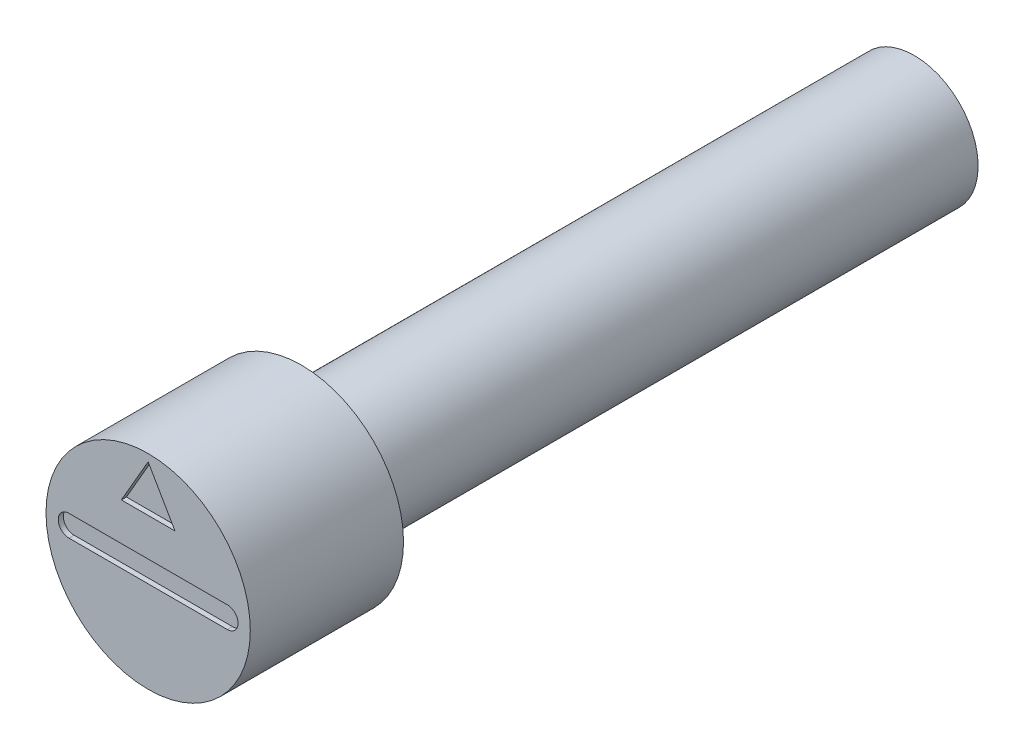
ISO-10303-21;
HEADER;
FILE_DESCRIPTION(('STEP AP214'),'2;1');
FILE_NAME('part.step','',(''),(''),'','','');
FILE_SCHEMA(('AUTOMOTIVE_DESIGN { 1 0 10303 214 1 1 1 1 }'));
ENDSEC;
DATA;
#1=APPLICATION_CONTEXT('core data for automotive mechanical design processes');
#2=APPLICATION_PROTOCOL_DEFINITION('international standard','automotive_design',2000,#1);
#3=PRODUCT_CONTEXT('',#1,'mechanical');
#4=PRODUCT('Part','Part','',(#3));
#5=PRODUCT_RELATED_PRODUCT_CATEGORY('part','',(#4));
#6=PRODUCT_DEFINITION_FORMATION('','',#4);
#7=PRODUCT_DEFINITION_CONTEXT('part definition',#1,'design');
#8=PRODUCT_DEFINITION('design','',#6,#7);
#9=PRODUCT_DEFINITION_SHAPE('','',#8);
#10=(LENGTH_UNIT() NAMED_UNIT(*) SI_UNIT(.MILLI.,.METRE.));
#11=(NAMED_UNIT(*) PLANE_ANGLE_UNIT() SI_UNIT($,.RADIAN.));
#12=(NAMED_UNIT(*) SI_UNIT($,.STERADIAN.) SOLID_ANGLE_UNIT());
#13=UNCERTAINTY_MEASURE_WITH_UNIT(LENGTH_MEASURE(1.E-05),#10,'distance_accuracy_value','');
#14=(GEOMETRIC_REPRESENTATION_CONTEXT(3) GLOBAL_UNCERTAINTY_ASSIGNED_CONTEXT((#13)) GLOBAL_UNIT_ASSIGNED_CONTEXT((#10,
#11,#12)) REPRESENTATION_CONTEXT('',''));
#15=CARTESIAN_POINT('',(0.,0.,0.));
#16=DIRECTION('',(0.,0.,1.));
#17=DIRECTION('',(1.,0.,0.));
#18=AXIS2_PLACEMENT_3D('',#15,#16,#17);
#19=CARTESIAN_POINT('',(0.999998,0.,0.));
#20=DIRECTION('',(0.,0.,1.));
#21=DIRECTION('',(1.,0.,0.));
#22=AXIS2_PLACEMENT_3D('',#19,#20,#21);
#23=PLANE('',#22);
#24=CARTESIAN_POINT('',(-1.55,0.,0.));
#25=DIRECTION('',(0.,0.,1.));
#26=DIRECTION('',(1.,0.,0.));
#27=AXIS2_PLACEMENT_3D('',#24,#25,#26);
#28=CIRCLE('',#27,0.21);
#29=CARTESIAN_POINT('',(-1.55,0.21,0.));
#30=VERTEX_POINT('',#29);
#31=CARTESIAN_POINT('',(-1.55,-0.21,0.));
#32=VERTEX_POINT('',#31);
#33=EDGE_CURVE('E52',#30,#32,#28,.T.);
#34=ORIENTED_EDGE('',*,*,#33,.F.);
#35=DIRECTION('',(-1.,0.,0.));
#36=VECTOR('',#35,1.);
#37=CARTESIAN_POINT('',(-1.55,0.21,0.));
#38=LINE('',#37,#36);
#39=CARTESIAN_POINT('',(1.55,0.21,0.));
#40=VERTEX_POINT('',#39);
#41=EDGE_CURVE('E116',#40,#30,#38,.T.);
#42=ORIENTED_EDGE('',*,*,#41,.F.);
#43=CARTESIAN_POINT('',(1.55,0.,0.));
#44=DIRECTION('',(0.,0.,1.));
#45=DIRECTION('',(1.,0.,0.));
#46=AXIS2_PLACEMENT_3D('',#43,#44,#45);
#47=CIRCLE('',#46,0.21);
#48=CARTESIAN_POINT('',(1.55,-0.21,0.));
#49=VERTEX_POINT('',#48);
#50=EDGE_CURVE('E119',#49,#40,#47,.T.);
#51=ORIENTED_EDGE('',*,*,#50,.F.);
#52=DIRECTION('',(1.,0.,0.));
#53=VECTOR('',#52,1.);
#54=CARTESIAN_POINT('',(-1.55,-0.21,0.));
#55=LINE('',#54,#53);
#56=EDGE_CURVE('E125',#32,#49,#55,.T.);
#57=ORIENTED_EDGE('',*,*,#56,.F.);
#58=EDGE_LOOP('',(#34,#42,#51,#57));
#59=FACE_BOUND('',#58,.T.);
#60=DIRECTION('',(-0.500000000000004,0.866025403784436,0.));
#61=VECTOR('',#60,1.);
#62=CARTESIAN_POINT('',(0.525000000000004,0.95,0.));
#63=LINE('',#62,#61);
#64=CARTESIAN_POINT('',(0.525000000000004,0.95,0.));
#65=VERTEX_POINT('',#64);
#66=CARTESIAN_POINT('',(0.,1.85932667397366,0.));
#67=VERTEX_POINT('',#66);
#68=EDGE_CURVE('E60',#65,#67,#63,.T.);
#69=ORIENTED_EDGE('',*,*,#68,.F.);
#70=DIRECTION('',(1.,0.,0.));
#71=VECTOR('',#70,1.);
#72=CARTESIAN_POINT('',(-0.525000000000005,0.95,0.));
#73=LINE('',#72,#71);
#74=CARTESIAN_POINT('',(-0.525000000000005,0.95,0.));
#75=VERTEX_POINT('',#74);
#76=EDGE_CURVE('E138',#75,#65,#73,.T.);
#77=ORIENTED_EDGE('',*,*,#76,.F.);
#78=DIRECTION('',(-0.500000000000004,-0.866025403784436,0.));
#79=VECTOR('',#78,1.);
#80=CARTESIAN_POINT('',(0.,1.85932667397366,0.));
#81=LINE('',#80,#79);
#82=EDGE_CURVE('E146',#67,#75,#81,.T.);
#83=ORIENTED_EDGE('',*,*,#82,.F.);
#84=EDGE_LOOP('',(#69,#77,#83));
#85=FACE_BOUND('',#84,.T.);
#86=CARTESIAN_POINT('',(0.,0.,0.));
#87=DIRECTION('',(0.,0.,-1.));
#88=DIRECTION('',(-1.,0.,0.));
#89=AXIS2_PLACEMENT_3D('',#86,#87,#88);
#90=CIRCLE('',#89,1.999996);
#91=CARTESIAN_POINT('',(-1.999996,0.,0.));
#92=VERTEX_POINT('',#91);
#93=EDGE_CURVE('E39',#92,#92,#90,.T.);
#94=ORIENTED_EDGE('',*,*,#93,.F.);
#95=EDGE_LOOP('',(#94));
#96=FACE_BOUND('',#95,.T.);
#97=ADVANCED_FACE('F36',(#59,#85,#96),#23,.T.);
#98=CARTESIAN_POINT('',(0.,0.,-1.499997));
#99=DIRECTION('',(0.,0.,-1.));
#100=DIRECTION('',(-1.,0.,0.));
#101=AXIS2_PLACEMENT_3D('',#98,#99,#100);
#102=CYLINDRICAL_SURFACE('',#101,1.999996);
#103=ORIENTED_EDGE('',*,*,#93,.T.);
#104=EDGE_LOOP('',(#103));
#105=FACE_BOUND('',#104,.T.);
#106=CARTESIAN_POINT('',(0.,0.,-2.999994));
#107=DIRECTION('',(0.,0.,-1.));
#108=DIRECTION('',(-1.,0.,0.));
#109=AXIS2_PLACEMENT_3D('',#106,#107,#108);
#110=CIRCLE('',#109,1.999996);
#111=CARTESIAN_POINT('',(-1.999996,0.,-2.999994));
#112=VERTEX_POINT('',#111);
#113=EDGE_CURVE('E157',#112,#112,#110,.T.);
#114=ORIENTED_EDGE('',*,*,#113,.F.);
#115=EDGE_LOOP('',(#114));
#116=FACE_BOUND('',#115,.T.);
#117=ADVANCED_FACE('F164',(#105,#116),#102,.T.);
#118=CARTESIAN_POINT('',(0.624998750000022,0.,-14.99997));
#119=DIRECTION('',(0.,0.,-1.));
#120=DIRECTION('',(-1.,0.,0.));
#121=AXIS2_PLACEMENT_3D('',#118,#119,#120);
#122=PLANE('',#121);
#123=CARTESIAN_POINT('',(0.,0.,-14.99997));
#124=DIRECTION('',(0.,0.,-1.));
#125=DIRECTION('',(-1.,0.,0.));
#126=AXIS2_PLACEMENT_3D('',#123,#124,#125);
#127=CIRCLE('',#126,1.2499975);
#128=CARTESIAN_POINT('',(-1.24999749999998,0.,-14.99997));
#129=VERTEX_POINT('',#128);
#130=EDGE_CURVE('E44',#129,#129,#127,.F.);
#131=ORIENTED_EDGE('',*,*,#130,.F.);
#132=EDGE_LOOP('',(#131));
#133=FACE_BOUND('',#132,.T.);
#134=ADVANCED_FACE('F173',(#133),#122,.T.);
#135=CARTESIAN_POINT('',(1.62499675,0.,-2.999994));
#136=DIRECTION('',(0.,0.,-1.));
#137=DIRECTION('',(-1.,0.,0.));
#138=AXIS2_PLACEMENT_3D('',#135,#136,#137);
#139=PLANE('',#138);
#140=CARTESIAN_POINT('',(0.,0.,-2.999994));
#141=DIRECTION('',(0.,0.,-1.));
#142=DIRECTION('',(-1.,0.,0.));
#143=AXIS2_PLACEMENT_3D('',#140,#141,#142);
#144=CIRCLE('',#143,1.2499975);
#145=CARTESIAN_POINT('',(-1.24999749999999,0.,-2.999994));
#146=VERTEX_POINT('',#145);
#147=EDGE_CURVE('E11',#146,#146,#144,.T.);
#148=ORIENTED_EDGE('',*,*,#147,.F.);
#149=EDGE_LOOP('',(#148));
#150=FACE_BOUND('',#149,.T.);
#151=ORIENTED_EDGE('',*,*,#113,.T.);
#152=EDGE_LOOP('',(#151));
#153=FACE_BOUND('',#152,.T.);
#154=ADVANCED_FACE('F180',(#150,#153),#139,.T.);
#155=CARTESIAN_POINT('',(0.,0.,-8.999982));
#156=DIRECTION('',(0.,0.,-1.));
#157=DIRECTION('',(-1.,0.,0.));
#158=AXIS2_PLACEMENT_3D('',#155,#156,#157);
#159=CYLINDRICAL_SURFACE('',#158,1.2499975);
#160=ORIENTED_EDGE('',*,*,#130,.T.);
#161=EDGE_LOOP('',(#160));
#162=FACE_BOUND('',#161,.T.);
#163=ORIENTED_EDGE('',*,*,#147,.T.);
#164=EDGE_LOOP('',(#163));
#165=FACE_BOUND('',#164,.T.);
#166=ADVANCED_FACE('F177',(#162,#165),#159,.T.);
#167=CARTESIAN_POINT('',(0.525000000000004,0.95,-0.1));
#168=DIRECTION('',(0.866025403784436,0.500000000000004,0.));
#169=DIRECTION('',(-0.500000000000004,0.866025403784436,0.));
#170=AXIS2_PLACEMENT_3D('',#167,#168,#169);
#171=PLANE('',#170);
#172=ORIENTED_EDGE('',*,*,#68,.T.);
#173=DIRECTION('',(0.,0.,1.));
#174=VECTOR('',#173,1.);
#175=CARTESIAN_POINT('',(0.,1.85932667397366,-0.1));
#176=LINE('',#175,#174);
#177=CARTESIAN_POINT('',(0.,1.85932667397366,-0.1));
#178=VERTEX_POINT('',#177);
#179=EDGE_CURVE('E144',#178,#67,#176,.T.);
#180=ORIENTED_EDGE('',*,*,#179,.F.);
#181=DIRECTION('',(-0.500000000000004,0.866025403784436,0.));
#182=VECTOR('',#181,1.);
#183=CARTESIAN_POINT('',(0.525000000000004,0.95,-0.1));
#184=LINE('',#183,#182);
#185=CARTESIAN_POINT('',(0.525000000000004,0.95,-0.1));
#186=VERTEX_POINT('',#185);
#187=EDGE_CURVE('E134',#186,#178,#184,.T.);
#188=ORIENTED_EDGE('',*,*,#187,.F.);
#189=DIRECTION('',(0.,0.,1.));
#190=VECTOR('',#189,1.);
#191=CARTESIAN_POINT('',(0.525000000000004,0.95,-0.1));
#192=LINE('',#191,#190);
#193=EDGE_CURVE('E151',#186,#65,#192,.T.);
#194=ORIENTED_EDGE('',*,*,#193,.T.);
#195=EDGE_LOOP('',(#172,#180,#188,#194));
#196=FACE_BOUND('',#195,.T.);
#197=ADVANCED_FACE('F169',(#196),#171,.F.);
#198=CARTESIAN_POINT('',(-0.525000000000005,0.95,-0.1));
#199=DIRECTION('',(0.,-1.,0.));
#200=DIRECTION('',(1.,0.,0.));
#201=AXIS2_PLACEMENT_3D('',#198,#199,#200);
#202=PLANE('',#201);
#203=ORIENTED_EDGE('',*,*,#76,.T.);
#204=ORIENTED_EDGE('',*,*,#193,.F.);
#205=DIRECTION('',(1.,0.,0.));
#206=VECTOR('',#205,1.);
#207=CARTESIAN_POINT('',(-0.525000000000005,0.95,-0.1));
#208=LINE('',#207,#206);
#209=CARTESIAN_POINT('',(-0.525000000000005,0.95,-0.1));
#210=VERTEX_POINT('',#209);
#211=EDGE_CURVE('E141',#210,#186,#208,.T.);
#212=ORIENTED_EDGE('',*,*,#211,.F.);
#213=DIRECTION('',(0.,0.,1.));
#214=VECTOR('',#213,1.);
#215=CARTESIAN_POINT('',(-0.525000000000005,0.95,-0.1));
#216=LINE('',#215,#214);
#217=EDGE_CURVE('E153',#210,#75,#216,.T.);
#218=ORIENTED_EDGE('',*,*,#217,.T.);
#219=EDGE_LOOP('',(#203,#204,#212,#218));
#220=FACE_BOUND('',#219,.T.);
#221=ADVANCED_FACE('F176',(#220),#202,.F.);
#222=CARTESIAN_POINT('',(0.,1.85932667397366,-0.1));
#223=DIRECTION('',(-0.866025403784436,0.500000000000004,0.));
#224=DIRECTION('',(-0.500000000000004,-0.866025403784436,0.));
#225=AXIS2_PLACEMENT_3D('',#222,#223,#224);
#226=PLANE('',#225);
#227=ORIENTED_EDGE('',*,*,#82,.T.);
#228=ORIENTED_EDGE('',*,*,#217,.F.);
#229=DIRECTION('',(-0.500000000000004,-0.866025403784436,0.));
#230=VECTOR('',#229,1.);
#231=CARTESIAN_POINT('',(0.,1.85932667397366,-0.1));
#232=LINE('',#231,#230);
#233=EDGE_CURVE('E137',#178,#210,#232,.T.);
#234=ORIENTED_EDGE('',*,*,#233,.F.);
#235=ORIENTED_EDGE('',*,*,#179,.T.);
#236=EDGE_LOOP('',(#227,#228,#234,#235));
#237=FACE_BOUND('',#236,.T.);
#238=ADVANCED_FACE('F232',(#237),#226,.F.);
#239=CARTESIAN_POINT('',(0.,0.,-0.1));
#240=DIRECTION('',(0.,0.,1.));
#241=DIRECTION('',(1.,0.,0.));
#242=AXIS2_PLACEMENT_3D('',#239,#240,#241);
#243=PLANE('',#242);
#244=ORIENTED_EDGE('',*,*,#187,.T.);
#245=ORIENTED_EDGE('',*,*,#233,.T.);
#246=ORIENTED_EDGE('',*,*,#211,.T.);
#247=EDGE_LOOP('',(#244,#245,#246));
#248=FACE_BOUND('',#247,.T.);
#249=ADVANCED_FACE('F243',(#248),#243,.T.);
#250=CARTESIAN_POINT('',(-1.55,0.,-0.1));
#251=DIRECTION('',(0.,0.,1.));
#252=DIRECTION('',(1.,0.,0.));
#253=AXIS2_PLACEMENT_3D('',#250,#251,#252);
#254=CYLINDRICAL_SURFACE('',#253,0.21);
#255=ORIENTED_EDGE('',*,*,#33,.T.);
#256=DIRECTION('',(0.,0.,1.));
#257=VECTOR('',#256,1.);
#258=CARTESIAN_POINT('',(-1.55,-0.21,-0.1));
#259=LINE('',#258,#257);
#260=CARTESIAN_POINT('',(-1.55,-0.21,-0.1));
#261=VERTEX_POINT('',#260);
#262=EDGE_CURVE('E94',#261,#32,#259,.T.);
#263=ORIENTED_EDGE('',*,*,#262,.F.);
#264=CARTESIAN_POINT('',(-1.55,0.,-0.1));
#265=DIRECTION('',(0.,0.,1.));
#266=DIRECTION('',(1.,0.,0.));
#267=AXIS2_PLACEMENT_3D('',#264,#265,#266);
#268=CIRCLE('',#267,0.21);
#269=CARTESIAN_POINT('',(-1.55,0.21,-0.1));
#270=VERTEX_POINT('',#269);
#271=EDGE_CURVE('E98',#270,#261,#268,.T.);
#272=ORIENTED_EDGE('',*,*,#271,.F.);
#273=DIRECTION('',(0.,0.,1.));
#274=VECTOR('',#273,1.);
#275=CARTESIAN_POINT('',(-1.55,0.21,-0.1));
#276=LINE('',#275,#274);
#277=EDGE_CURVE('E129',#270,#30,#276,.T.);
#278=ORIENTED_EDGE('',*,*,#277,.T.);
#279=EDGE_LOOP('',(#255,#263,#272,#278));
#280=FACE_BOUND('',#279,.T.);
#281=ADVANCED_FACE('F96',(#280),#254,.F.);
#282=CARTESIAN_POINT('',(-1.55,0.21,-0.1));
#283=DIRECTION('',(0.,1.,0.));
#284=DIRECTION('',(0.,0.,1.));
#285=AXIS2_PLACEMENT_3D('',#282,#283,#284);
#286=PLANE('',#285);
#287=ORIENTED_EDGE('',*,*,#41,.T.);
#288=ORIENTED_EDGE('',*,*,#277,.F.);
#289=DIRECTION('',(-1.,0.,0.));
#290=VECTOR('',#289,1.);
#291=CARTESIAN_POINT('',(-1.55,0.21,-0.1));
#292=LINE('',#291,#290);
#293=CARTESIAN_POINT('',(1.55,0.21,-0.1));
#294=VERTEX_POINT('',#293);
#295=EDGE_CURVE('E104',#294,#270,#292,.T.);
#296=ORIENTED_EDGE('',*,*,#295,.F.);
#297=DIRECTION('',(0.,0.,1.));
#298=VECTOR('',#297,1.);
#299=CARTESIAN_POINT('',(1.55,0.21,-0.1));
#300=LINE('',#299,#298);
#301=EDGE_CURVE('E131',#294,#40,#300,.T.);
#302=ORIENTED_EDGE('',*,*,#301,.T.);
#303=EDGE_LOOP('',(#287,#288,#296,#302));
#304=FACE_BOUND('',#303,.T.);
#305=ADVANCED_FACE('F263',(#304),#286,.F.);
#306=CARTESIAN_POINT('',(1.55,0.,-0.1));
#307=DIRECTION('',(0.,0.,1.));
#308=DIRECTION('',(1.,0.,0.));
#309=AXIS2_PLACEMENT_3D('',#306,#307,#308);
#310=CYLINDRICAL_SURFACE('',#309,0.21);
#311=ORIENTED_EDGE('',*,*,#50,.T.);
#312=ORIENTED_EDGE('',*,*,#301,.F.);
#313=CARTESIAN_POINT('',(1.55,0.,-0.1));
#314=DIRECTION('',(0.,0.,1.));
#315=DIRECTION('',(1.,0.,0.));
#316=AXIS2_PLACEMENT_3D('',#313,#314,#315);
#317=CIRCLE('',#316,0.21);
#318=CARTESIAN_POINT('',(1.55,-0.21,-0.1));
#319=VERTEX_POINT('',#318);
#320=EDGE_CURVE('E112',#319,#294,#317,.T.);
#321=ORIENTED_EDGE('',*,*,#320,.F.);
#322=DIRECTION('',(0.,0.,1.));
#323=VECTOR('',#322,1.);
#324=CARTESIAN_POINT('',(1.55,-0.21,-0.1));
#325=LINE('',#324,#323);
#326=EDGE_CURVE('E103',#319,#49,#325,.T.);
#327=ORIENTED_EDGE('',*,*,#326,.T.);
#328=EDGE_LOOP('',(#311,#312,#321,#327));
#329=FACE_BOUND('',#328,.T.);
#330=ADVANCED_FACE('F273',(#329),#310,.F.);
#331=CARTESIAN_POINT('',(-1.55,-0.21,-0.1));
#332=DIRECTION('',(0.,-1.,0.));
#333=DIRECTION('',(0.,0.,-1.));
#334=AXIS2_PLACEMENT_3D('',#331,#332,#333);
#335=PLANE('',#334);
#336=ORIENTED_EDGE('',*,*,#56,.T.);
#337=ORIENTED_EDGE('',*,*,#326,.F.);
#338=DIRECTION('',(1.,0.,0.));
#339=VECTOR('',#338,1.);
#340=CARTESIAN_POINT('',(-1.55,-0.21,-0.1));
#341=LINE('',#340,#339);
#342=EDGE_CURVE('E107',#261,#319,#341,.T.);
#343=ORIENTED_EDGE('',*,*,#342,.F.);
#344=ORIENTED_EDGE('',*,*,#262,.T.);
#345=EDGE_LOOP('',(#336,#337,#343,#344));
#346=FACE_BOUND('',#345,.T.);
#347=ADVANCED_FACE('F108',(#346),#335,.F.);
#348=CARTESIAN_POINT('',(-1.55,0.,-0.1));
#349=DIRECTION('',(0.,0.,1.));
#350=DIRECTION('',(1.,0.,0.));
#351=AXIS2_PLACEMENT_3D('',#348,#349,#350);
#352=PLANE('',#351);
#353=ORIENTED_EDGE('',*,*,#271,.T.);
#354=ORIENTED_EDGE('',*,*,#342,.T.);
#355=ORIENTED_EDGE('',*,*,#320,.T.);
#356=ORIENTED_EDGE('',*,*,#295,.T.);
#357=EDGE_LOOP('',(#353,#354,#355,#356));
#358=FACE_BOUND('',#357,.T.);
#359=ADVANCED_FACE('F114',(#358),#352,.T.);
#360=CLOSED_SHELL('',(#97,#117,#134,#154,#166,#197,#221,#238,#249,#281,#305,#330,#347,#359));
#361=MANIFOLD_SOLID_BREP('B2',#360);
#362=ADVANCED_BREP_SHAPE_REPRESENTATION('',(#18,#361),#14);
#363=SHAPE_DEFINITION_REPRESENTATION(#9,#362);
ENDSEC;
END-ISO-10303-21;
